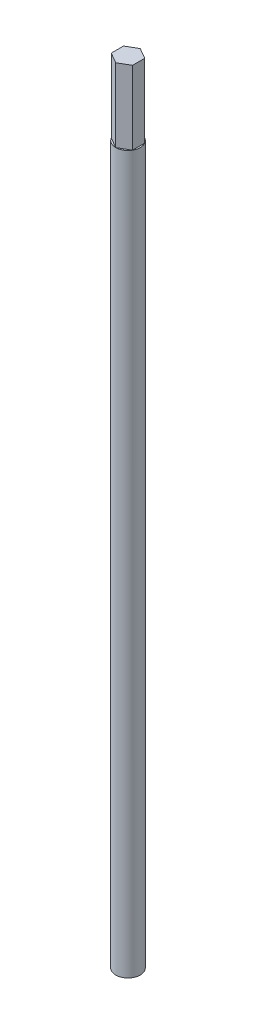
ISO-10303-21;
HEADER;
FILE_DESCRIPTION(('STEP AP214'),'2;1');
FILE_NAME('part.step','',(''),(''),'','','');
FILE_SCHEMA(('AUTOMOTIVE_DESIGN { 1 0 10303 214 1 1 1 1 }'));
ENDSEC;
DATA;
#1=APPLICATION_CONTEXT('core data for automotive mechanical design processes');
#2=APPLICATION_PROTOCOL_DEFINITION('international standard','automotive_design',2000,#1);
#3=PRODUCT_CONTEXT('',#1,'mechanical');
#4=PRODUCT('Part','Part','',(#3));
#5=PRODUCT_RELATED_PRODUCT_CATEGORY('part','',(#4));
#6=PRODUCT_DEFINITION_FORMATION('','',#4);
#7=PRODUCT_DEFINITION_CONTEXT('part definition',#1,'design');
#8=PRODUCT_DEFINITION('design','',#6,#7);
#9=PRODUCT_DEFINITION_SHAPE('','',#8);
#10=(LENGTH_UNIT() NAMED_UNIT(*) SI_UNIT(.MILLI.,.METRE.));
#11=(NAMED_UNIT(*) PLANE_ANGLE_UNIT() SI_UNIT($,.RADIAN.));
#12=(NAMED_UNIT(*) SI_UNIT($,.STERADIAN.) SOLID_ANGLE_UNIT());
#13=UNCERTAINTY_MEASURE_WITH_UNIT(LENGTH_MEASURE(1.E-05),#10,'distance_accuracy_value','');
#14=(GEOMETRIC_REPRESENTATION_CONTEXT(3) GLOBAL_UNCERTAINTY_ASSIGNED_CONTEXT((#13)) GLOBAL_UNIT_ASSIGNED_CONTEXT((#10,
#11,#12)) REPRESENTATION_CONTEXT('',''));
#15=CARTESIAN_POINT('',(0.,0.,0.));
#16=DIRECTION('',(0.,0.,1.));
#17=DIRECTION('',(1.,0.,0.));
#18=AXIS2_PLACEMENT_3D('',#15,#16,#17);
#19=CARTESIAN_POINT('',(0.,64.5,1.));
#20=DIRECTION('',(0.,-1.,0.));
#21=DIRECTION('',(0.,0.,-1.));
#22=AXIS2_PLACEMENT_3D('',#19,#20,#21);
#23=CYLINDRICAL_SURFACE('',#22,1.);
#24=DIRECTION('',(0.,-1.,0.));
#25=VECTOR('',#24,1.);
#26=CARTESIAN_POINT('',(0.5,64.5,0.13397459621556));
#27=LINE('',#26,#25);
#28=CARTESIAN_POINT('',(0.5,1.5,0.13397459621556));
#29=VERTEX_POINT('',#28);
#30=CARTESIAN_POINT('',(0.5,0.,0.13397459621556));
#31=VERTEX_POINT('',#30);
#32=EDGE_CURVE('E237',#29,#31,#27,.T.);
#33=ORIENTED_EDGE('',*,*,#32,.F.);
#34=CARTESIAN_POINT('',(0.,1.5,1.));
#35=DIRECTION('',(0.,-1.,0.));
#36=DIRECTION('',(0.,0.,-1.));
#37=AXIS2_PLACEMENT_3D('',#34,#35,#36);
#38=CIRCLE('',#37,1.);
#39=CARTESIAN_POINT('',(-0.5,1.5,0.133974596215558));
#40=VERTEX_POINT('',#39);
#41=EDGE_CURVE('E12',#40,#29,#38,.T.);
#42=ORIENTED_EDGE('',*,*,#41,.F.);
#43=DIRECTION('',(0.,-1.,0.));
#44=VECTOR('',#43,1.);
#45=CARTESIAN_POINT('',(-0.499999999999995,64.5,0.133974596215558));
#46=LINE('',#45,#44);
#47=CARTESIAN_POINT('',(-0.5,0.,0.13397459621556));
#48=VERTEX_POINT('',#47);
#49=EDGE_CURVE('E235',#48,#40,#46,.F.);
#50=ORIENTED_EDGE('',*,*,#49,.F.);
#51=CARTESIAN_POINT('',(0.,0.,1.));
#52=DIRECTION('',(0.,1.,0.));
#53=DIRECTION('',(0.,0.,1.));
#54=AXIS2_PLACEMENT_3D('',#51,#52,#53);
#55=CIRCLE('',#54,1.);
#56=EDGE_CURVE('E66',#48,#31,#55,.T.);
#57=ORIENTED_EDGE('',*,*,#56,.T.);
#58=EDGE_LOOP('',(#33,#42,#50,#57));
#59=FACE_BOUND('',#58,.T.);
#60=CARTESIAN_POINT('',(0.,58.5,1.));
#61=DIRECTION('',(0.,1.,0.));
#62=DIRECTION('',(0.,0.,1.));
#63=AXIS2_PLACEMENT_3D('',#60,#61,#62);
#64=CIRCLE('',#63,1.);
#65=CARTESIAN_POINT('',(0.866025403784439,58.5,0.499999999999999));
#66=VERTEX_POINT('',#65);
#67=CARTESIAN_POINT('',(0.,58.5,0.));
#68=VERTEX_POINT('',#67);
#69=EDGE_CURVE('E151',#66,#68,#64,.T.);
#70=ORIENTED_EDGE('',*,*,#69,.F.);
#71=CARTESIAN_POINT('',(0.,58.5,1.));
#72=DIRECTION('',(0.,1.,0.));
#73=DIRECTION('',(0.,0.,1.));
#74=AXIS2_PLACEMENT_3D('',#71,#72,#73);
#75=CIRCLE('',#74,1.);
#76=CARTESIAN_POINT('',(0.866025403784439,58.5,1.5));
#77=VERTEX_POINT('',#76);
#78=EDGE_CURVE('E146',#77,#66,#75,.T.);
#79=ORIENTED_EDGE('',*,*,#78,.F.);
#80=CARTESIAN_POINT('',(0.,58.5,1.));
#81=DIRECTION('',(0.,1.,0.));
#82=DIRECTION('',(0.,0.,1.));
#83=AXIS2_PLACEMENT_3D('',#80,#81,#82);
#84=CIRCLE('',#83,1.);
#85=CARTESIAN_POINT('',(0.,58.5,2.));
#86=VERTEX_POINT('',#85);
#87=EDGE_CURVE('E178',#86,#77,#84,.T.);
#88=ORIENTED_EDGE('',*,*,#87,.F.);
#89=CARTESIAN_POINT('',(0.,58.5,1.));
#90=DIRECTION('',(0.,1.,0.));
#91=DIRECTION('',(0.,0.,1.));
#92=AXIS2_PLACEMENT_3D('',#89,#90,#91);
#93=CIRCLE('',#92,1.);
#94=CARTESIAN_POINT('',(-0.866025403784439,58.5,1.5));
#95=VERTEX_POINT('',#94);
#96=EDGE_CURVE('E189',#95,#86,#93,.T.);
#97=ORIENTED_EDGE('',*,*,#96,.F.);
#98=CARTESIAN_POINT('',(0.,58.5,1.));
#99=DIRECTION('',(0.,1.,0.));
#100=DIRECTION('',(0.,0.,1.));
#101=AXIS2_PLACEMENT_3D('',#98,#99,#100);
#102=CIRCLE('',#101,1.);
#103=CARTESIAN_POINT('',(-0.86602540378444,58.5,0.5));
#104=VERTEX_POINT('',#103);
#105=EDGE_CURVE('E199',#104,#95,#102,.T.);
#106=ORIENTED_EDGE('',*,*,#105,.F.);
#107=CARTESIAN_POINT('',(0.,58.5,1.));
#108=DIRECTION('',(0.,1.,0.));
#109=DIRECTION('',(0.,0.,1.));
#110=AXIS2_PLACEMENT_3D('',#107,#108,#109);
#111=CIRCLE('',#110,1.);
#112=EDGE_CURVE('E163',#68,#104,#111,.T.);
#113=ORIENTED_EDGE('',*,*,#112,.F.);
#114=EDGE_LOOP('',(#70,#79,#88,#97,#106,#113));
#115=FACE_BOUND('',#114,.T.);
#116=ADVANCED_FACE('F59',(#59,#115),#23,.T.);
#117=CARTESIAN_POINT('',(0.,64.5,1.));
#118=DIRECTION('',(0.,1.,0.));
#119=DIRECTION('',(0.,0.,1.));
#120=AXIS2_PLACEMENT_3D('',#117,#118,#119);
#121=PLANE('',#120);
#122=DIRECTION('',(0.,0.,-1.));
#123=VECTOR('',#122,1.);
#124=CARTESIAN_POINT('',(0.866025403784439,64.5,0.));
#125=LINE('',#124,#123);
#126=CARTESIAN_POINT('',(0.866025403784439,64.5,1.5));
#127=VERTEX_POINT('',#126);
#128=CARTESIAN_POINT('',(0.866025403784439,64.5,0.499999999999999));
#129=VERTEX_POINT('',#128);
#130=EDGE_CURVE('E153',#127,#129,#125,.T.);
#131=ORIENTED_EDGE('',*,*,#130,.T.);
#132=DIRECTION('',(-0.866025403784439,0.,-0.5));
#133=VECTOR('',#132,1.);
#134=CARTESIAN_POINT('',(0.,64.5,0.));
#135=LINE('',#134,#133);
#136=CARTESIAN_POINT('',(0.,64.5,0.));
#137=VERTEX_POINT('',#136);
#138=EDGE_CURVE('E141',#129,#137,#135,.T.);
#139=ORIENTED_EDGE('',*,*,#138,.T.);
#140=DIRECTION('',(-0.866025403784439,0.,0.5));
#141=VECTOR('',#140,1.);
#142=CARTESIAN_POINT('',(0.,64.5,0.));
#143=LINE('',#142,#141);
#144=CARTESIAN_POINT('',(-0.86602540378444,64.5,0.5));
#145=VERTEX_POINT('',#144);
#146=EDGE_CURVE('E205',#137,#145,#143,.T.);
#147=ORIENTED_EDGE('',*,*,#146,.T.);
#148=DIRECTION('',(0.,0.,1.));
#149=VECTOR('',#148,1.);
#150=CARTESIAN_POINT('',(-0.866025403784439,64.5,0.));
#151=LINE('',#150,#149);
#152=CARTESIAN_POINT('',(-0.866025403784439,64.5,1.5));
#153=VERTEX_POINT('',#152);
#154=EDGE_CURVE('E73',#145,#153,#151,.T.);
#155=ORIENTED_EDGE('',*,*,#154,.T.);
#156=DIRECTION('',(0.866025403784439,0.,0.5));
#157=VECTOR('',#156,1.);
#158=CARTESIAN_POINT('',(-0.866025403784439,64.5,1.5));
#159=LINE('',#158,#157);
#160=CARTESIAN_POINT('',(0.,64.5,2.));
#161=VERTEX_POINT('',#160);
#162=EDGE_CURVE('E184',#153,#161,#159,.T.);
#163=ORIENTED_EDGE('',*,*,#162,.T.);
#164=DIRECTION('',(0.866025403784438,0.,-0.5));
#165=VECTOR('',#164,1.);
#166=CARTESIAN_POINT('',(0.86602540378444,64.5,1.5));
#167=LINE('',#166,#165);
#168=EDGE_CURVE('E170',#161,#127,#167,.T.);
#169=ORIENTED_EDGE('',*,*,#168,.T.);
#170=EDGE_LOOP('',(#131,#139,#147,#155,#163,#169));
#171=FACE_BOUND('',#170,.T.);
#172=ADVANCED_FACE('F269',(#171),#121,.T.);
#173=CARTESIAN_POINT('',(0.,0.,1.));
#174=DIRECTION('',(0.,1.,0.));
#175=DIRECTION('',(0.,0.,1.));
#176=AXIS2_PLACEMENT_3D('',#173,#174,#175);
#177=PLANE('',#176);
#178=DIRECTION('',(0.,0.,-1.));
#179=VECTOR('',#178,1.);
#180=CARTESIAN_POINT('',(0.5,0.,1.));
#181=LINE('',#180,#179);
#182=CARTESIAN_POINT('',(0.5,0.,1.));
#183=VERTEX_POINT('',#182);
#184=EDGE_CURVE('E224',#183,#31,#181,.T.);
#185=ORIENTED_EDGE('',*,*,#184,.T.);
#186=ORIENTED_EDGE('',*,*,#56,.F.);
#187=DIRECTION('',(0.,0.,-1.));
#188=VECTOR('',#187,1.);
#189=CARTESIAN_POINT('',(-0.5,0.,1.));
#190=LINE('',#189,#188);
#191=CARTESIAN_POINT('',(-0.5,0.,1.));
#192=VERTEX_POINT('',#191);
#193=EDGE_CURVE('E227',#192,#48,#190,.T.);
#194=ORIENTED_EDGE('',*,*,#193,.F.);
#195=DIRECTION('',(1.,0.,0.));
#196=VECTOR('',#195,1.);
#197=CARTESIAN_POINT('',(-0.5,0.,1.));
#198=LINE('',#197,#196);
#199=EDGE_CURVE('E221',#192,#183,#198,.T.);
#200=ORIENTED_EDGE('',*,*,#199,.T.);
#201=EDGE_LOOP('',(#185,#186,#194,#200));
#202=FACE_BOUND('',#201,.T.);
#203=ADVANCED_FACE('F246',(#202),#177,.F.);
#204=CARTESIAN_POINT('',(-0.5,1.5,1.));
#205=DIRECTION('',(0.,-1.,0.));
#206=DIRECTION('',(0.,0.,-1.));
#207=AXIS2_PLACEMENT_3D('',#204,#205,#206);
#208=PLANE('',#207);
#209=ORIENTED_EDGE('',*,*,#41,.T.);
#210=DIRECTION('',(0.,0.,-1.));
#211=VECTOR('',#210,1.);
#212=CARTESIAN_POINT('',(0.5,1.5,1.));
#213=LINE('',#212,#211);
#214=CARTESIAN_POINT('',(0.5,1.5,1.));
#215=VERTEX_POINT('',#214);
#216=EDGE_CURVE('E232',#215,#29,#213,.T.);
#217=ORIENTED_EDGE('',*,*,#216,.F.);
#218=DIRECTION('',(-1.,0.,0.));
#219=VECTOR('',#218,1.);
#220=CARTESIAN_POINT('',(-0.5,1.5,1.));
#221=LINE('',#220,#219);
#222=CARTESIAN_POINT('',(-0.5,1.5,1.));
#223=VERTEX_POINT('',#222);
#224=EDGE_CURVE('E217',#215,#223,#221,.T.);
#225=ORIENTED_EDGE('',*,*,#224,.T.);
#226=DIRECTION('',(0.,0.,-1.));
#227=VECTOR('',#226,1.);
#228=CARTESIAN_POINT('',(-0.5,1.5,1.));
#229=LINE('',#228,#227);
#230=EDGE_CURVE('E229',#223,#40,#229,.T.);
#231=ORIENTED_EDGE('',*,*,#230,.T.);
#232=EDGE_LOOP('',(#209,#217,#225,#231));
#233=FACE_BOUND('',#232,.T.);
#234=ADVANCED_FACE('F251',(#233),#208,.T.);
#235=CARTESIAN_POINT('',(0.5,0.,1.));
#236=DIRECTION('',(-1.,0.,0.));
#237=DIRECTION('',(0.,0.,1.));
#238=AXIS2_PLACEMENT_3D('',#235,#236,#237);
#239=PLANE('',#238);
#240=ORIENTED_EDGE('',*,*,#32,.T.);
#241=ORIENTED_EDGE('',*,*,#184,.F.);
#242=DIRECTION('',(0.,1.,0.));
#243=VECTOR('',#242,1.);
#244=CARTESIAN_POINT('',(0.5,0.,1.));
#245=LINE('',#244,#243);
#246=EDGE_CURVE('E81',#183,#215,#245,.T.);
#247=ORIENTED_EDGE('',*,*,#246,.T.);
#248=ORIENTED_EDGE('',*,*,#216,.T.);
#249=EDGE_LOOP('',(#240,#241,#247,#248));
#250=FACE_BOUND('',#249,.T.);
#251=ADVANCED_FACE('F248',(#250),#239,.T.);
#252=CARTESIAN_POINT('',(-0.5,0.,1.));
#253=DIRECTION('',(1.,0.,0.));
#254=DIRECTION('',(0.,1.,0.));
#255=AXIS2_PLACEMENT_3D('',#252,#253,#254);
#256=PLANE('',#255);
#257=ORIENTED_EDGE('',*,*,#49,.T.);
#258=ORIENTED_EDGE('',*,*,#230,.F.);
#259=DIRECTION('',(0.,-1.,0.));
#260=VECTOR('',#259,1.);
#261=CARTESIAN_POINT('',(-0.5,0.,1.));
#262=LINE('',#261,#260);
#263=EDGE_CURVE('E219',#223,#192,#262,.T.);
#264=ORIENTED_EDGE('',*,*,#263,.T.);
#265=ORIENTED_EDGE('',*,*,#193,.T.);
#266=EDGE_LOOP('',(#257,#258,#264,#265));
#267=FACE_BOUND('',#266,.T.);
#268=ADVANCED_FACE('F255',(#267),#256,.T.);
#269=CARTESIAN_POINT('',(0.,0.,1.));
#270=DIRECTION('',(0.,0.,-1.));
#271=DIRECTION('',(-1.,0.,0.));
#272=AXIS2_PLACEMENT_3D('',#269,#270,#271);
#273=PLANE('',#272);
#274=ORIENTED_EDGE('',*,*,#246,.F.);
#275=ORIENTED_EDGE('',*,*,#199,.F.);
#276=ORIENTED_EDGE('',*,*,#263,.F.);
#277=ORIENTED_EDGE('',*,*,#224,.F.);
#278=EDGE_LOOP('',(#274,#275,#276,#277));
#279=FACE_BOUND('',#278,.T.);
#280=ADVANCED_FACE('F256',(#279),#273,.T.);
#281=CARTESIAN_POINT('',(0.,58.5,0.));
#282=DIRECTION('',(-0.5,0.,-0.866025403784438));
#283=DIRECTION('',(-0.866025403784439,0.,0.5));
#284=AXIS2_PLACEMENT_3D('',#281,#282,#283);
#285=PLANE('',#284);
#286=ORIENTED_EDGE('',*,*,#146,.F.);
#287=DIRECTION('',(0.,1.,0.));
#288=VECTOR('',#287,1.);
#289=CARTESIAN_POINT('',(0.,58.5,0.));
#290=LINE('',#289,#288);
#291=EDGE_CURVE('E210',#68,#137,#290,.T.);
#292=ORIENTED_EDGE('',*,*,#291,.F.);
#293=DIRECTION('',(-0.866025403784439,0.,0.5));
#294=VECTOR('',#293,1.);
#295=CARTESIAN_POINT('',(0.,58.5,0.));
#296=LINE('',#295,#294);
#297=EDGE_CURVE('E206',#68,#104,#296,.T.);
#298=ORIENTED_EDGE('',*,*,#297,.T.);
#299=DIRECTION('',(0.,1.,0.));
#300=VECTOR('',#299,1.);
#301=CARTESIAN_POINT('',(-0.86602540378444,58.5,0.5));
#302=LINE('',#301,#300);
#303=EDGE_CURVE('E213',#104,#145,#302,.T.);
#304=ORIENTED_EDGE('',*,*,#303,.T.);
#305=EDGE_LOOP('',(#286,#292,#298,#304));
#306=FACE_BOUND('',#305,.T.);
#307=ADVANCED_FACE('F258',(#306),#285,.T.);
#308=CARTESIAN_POINT('',(0.,58.5,0.));
#309=DIRECTION('',(0.,1.,0.));
#310=DIRECTION('',(0.,0.,1.));
#311=AXIS2_PLACEMENT_3D('',#308,#309,#310);
#312=PLANE('',#311);
#313=ORIENTED_EDGE('',*,*,#297,.F.);
#314=ORIENTED_EDGE('',*,*,#112,.T.);
#315=EDGE_LOOP('',(#313,#314));
#316=FACE_BOUND('',#315,.T.);
#317=ADVANCED_FACE('F264',(#316),#312,.T.);
#318=CARTESIAN_POINT('',(-0.866025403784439,58.5,0.));
#319=DIRECTION('',(-1.,0.,0.));
#320=DIRECTION('',(0.,0.,1.));
#321=AXIS2_PLACEMENT_3D('',#318,#319,#320);
#322=PLANE('',#321);
#323=ORIENTED_EDGE('',*,*,#154,.F.);
#324=ORIENTED_EDGE('',*,*,#303,.F.);
#325=DIRECTION('',(0.,0.,1.));
#326=VECTOR('',#325,1.);
#327=CARTESIAN_POINT('',(-0.866025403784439,58.5,0.));
#328=LINE('',#327,#326);
#329=EDGE_CURVE('E198',#104,#95,#328,.T.);
#330=ORIENTED_EDGE('',*,*,#329,.T.);
#331=DIRECTION('',(0.,1.,0.));
#332=VECTOR('',#331,1.);
#333=CARTESIAN_POINT('',(-0.866025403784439,58.5,1.5));
#334=LINE('',#333,#332);
#335=EDGE_CURVE('E196',#95,#153,#334,.T.);
#336=ORIENTED_EDGE('',*,*,#335,.T.);
#337=EDGE_LOOP('',(#323,#324,#330,#336));
#338=FACE_BOUND('',#337,.T.);
#339=ADVANCED_FACE('F321',(#338),#322,.T.);
#340=CARTESIAN_POINT('',(0.,58.5,0.));
#341=DIRECTION('',(0.,1.,0.));
#342=DIRECTION('',(0.,0.,1.));
#343=AXIS2_PLACEMENT_3D('',#340,#341,#342);
#344=PLANE('',#343);
#345=ORIENTED_EDGE('',*,*,#329,.F.);
#346=ORIENTED_EDGE('',*,*,#105,.T.);
#347=EDGE_LOOP('',(#345,#346));
#348=FACE_BOUND('',#347,.T.);
#349=ADVANCED_FACE('F331',(#348),#344,.T.);
#350=CARTESIAN_POINT('',(-0.866025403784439,58.5,1.5));
#351=DIRECTION('',(-0.5,0.,0.866025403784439));
#352=DIRECTION('',(0.866025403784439,0.,0.5));
#353=AXIS2_PLACEMENT_3D('',#350,#351,#352);
#354=PLANE('',#353);
#355=ORIENTED_EDGE('',*,*,#162,.F.);
#356=ORIENTED_EDGE('',*,*,#335,.F.);
#357=DIRECTION('',(0.866025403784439,0.,0.5));
#358=VECTOR('',#357,1.);
#359=CARTESIAN_POINT('',(-0.866025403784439,58.5,1.5));
#360=LINE('',#359,#358);
#361=EDGE_CURVE('E188',#95,#86,#360,.T.);
#362=ORIENTED_EDGE('',*,*,#361,.T.);
#363=DIRECTION('',(0.,1.,0.));
#364=VECTOR('',#363,1.);
#365=CARTESIAN_POINT('',(0.,58.5,2.));
#366=LINE('',#365,#364);
#367=EDGE_CURVE('E185',#86,#161,#366,.T.);
#368=ORIENTED_EDGE('',*,*,#367,.T.);
#369=EDGE_LOOP('',(#355,#356,#362,#368));
#370=FACE_BOUND('',#369,.T.);
#371=ADVANCED_FACE('F340',(#370),#354,.T.);
#372=CARTESIAN_POINT('',(0.,58.5,0.));
#373=DIRECTION('',(0.,1.,0.));
#374=DIRECTION('',(0.,0.,1.));
#375=AXIS2_PLACEMENT_3D('',#372,#373,#374);
#376=PLANE('',#375);
#377=ORIENTED_EDGE('',*,*,#361,.F.);
#378=ORIENTED_EDGE('',*,*,#96,.T.);
#379=EDGE_LOOP('',(#377,#378));
#380=FACE_BOUND('',#379,.T.);
#381=ADVANCED_FACE('F350',(#380),#376,.T.);
#382=CARTESIAN_POINT('',(0.86602540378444,58.5,1.5));
#383=DIRECTION('',(0.5,0.,0.866025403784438));
#384=DIRECTION('',(0.866025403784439,0.,-0.5));
#385=AXIS2_PLACEMENT_3D('',#382,#383,#384);
#386=PLANE('',#385);
#387=ORIENTED_EDGE('',*,*,#168,.F.);
#388=ORIENTED_EDGE('',*,*,#367,.F.);
#389=DIRECTION('',(0.866025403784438,0.,-0.5));
#390=VECTOR('',#389,1.);
#391=CARTESIAN_POINT('',(0.86602540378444,58.5,1.5));
#392=LINE('',#391,#390);
#393=EDGE_CURVE('E177',#86,#77,#392,.T.);
#394=ORIENTED_EDGE('',*,*,#393,.T.);
#395=DIRECTION('',(0.,1.,0.));
#396=VECTOR('',#395,1.);
#397=CARTESIAN_POINT('',(0.866025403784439,58.5,1.5));
#398=LINE('',#397,#396);
#399=EDGE_CURVE('E168',#77,#127,#398,.T.);
#400=ORIENTED_EDGE('',*,*,#399,.T.);
#401=EDGE_LOOP('',(#387,#388,#394,#400));
#402=FACE_BOUND('',#401,.T.);
#403=ADVANCED_FACE('F360',(#402),#386,.T.);
#404=CARTESIAN_POINT('',(0.,58.5,0.));
#405=DIRECTION('',(0.,1.,0.));
#406=DIRECTION('',(0.,0.,1.));
#407=AXIS2_PLACEMENT_3D('',#404,#405,#406);
#408=PLANE('',#407);
#409=ORIENTED_EDGE('',*,*,#393,.F.);
#410=ORIENTED_EDGE('',*,*,#87,.T.);
#411=EDGE_LOOP('',(#409,#410));
#412=FACE_BOUND('',#411,.T.);
#413=ADVANCED_FACE('F370',(#412),#408,.T.);
#414=CARTESIAN_POINT('',(0.866025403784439,58.5,0.));
#415=DIRECTION('',(1.,0.,0.));
#416=DIRECTION('',(0.,0.,-1.));
#417=AXIS2_PLACEMENT_3D('',#414,#415,#416);
#418=PLANE('',#417);
#419=ORIENTED_EDGE('',*,*,#130,.F.);
#420=ORIENTED_EDGE('',*,*,#399,.F.);
#421=DIRECTION('',(0.,0.,-1.));
#422=VECTOR('',#421,1.);
#423=CARTESIAN_POINT('',(0.866025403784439,58.5,0.));
#424=LINE('',#423,#422);
#425=EDGE_CURVE('E145',#77,#66,#424,.T.);
#426=ORIENTED_EDGE('',*,*,#425,.T.);
#427=DIRECTION('',(0.,1.,0.));
#428=VECTOR('',#427,1.);
#429=CARTESIAN_POINT('',(0.866025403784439,58.5,0.499999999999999));
#430=LINE('',#429,#428);
#431=EDGE_CURVE('E135',#66,#129,#430,.T.);
#432=ORIENTED_EDGE('',*,*,#431,.T.);
#433=EDGE_LOOP('',(#419,#420,#426,#432));
#434=FACE_BOUND('',#433,.T.);
#435=ADVANCED_FACE('F166',(#434),#418,.T.);
#436=CARTESIAN_POINT('',(0.,58.5,0.));
#437=DIRECTION('',(0.,1.,0.));
#438=DIRECTION('',(0.,0.,1.));
#439=AXIS2_PLACEMENT_3D('',#436,#437,#438);
#440=PLANE('',#439);
#441=ORIENTED_EDGE('',*,*,#425,.F.);
#442=ORIENTED_EDGE('',*,*,#78,.T.);
#443=EDGE_LOOP('',(#441,#442));
#444=FACE_BOUND('',#443,.T.);
#445=ADVANCED_FACE('F172',(#444),#440,.T.);
#446=CARTESIAN_POINT('',(0.,58.5,0.));
#447=DIRECTION('',(0.5,0.,-0.866025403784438));
#448=DIRECTION('',(-0.866025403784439,0.,-0.5));
#449=AXIS2_PLACEMENT_3D('',#446,#447,#448);
#450=PLANE('',#449);
#451=ORIENTED_EDGE('',*,*,#138,.F.);
#452=ORIENTED_EDGE('',*,*,#431,.F.);
#453=DIRECTION('',(-0.866025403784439,0.,-0.5));
#454=VECTOR('',#453,1.);
#455=CARTESIAN_POINT('',(0.,58.5,0.));
#456=LINE('',#455,#454);
#457=EDGE_CURVE('E138',#66,#68,#456,.T.);
#458=ORIENTED_EDGE('',*,*,#457,.T.);
#459=ORIENTED_EDGE('',*,*,#291,.T.);
#460=EDGE_LOOP('',(#451,#452,#458,#459));
#461=FACE_BOUND('',#460,.T.);
#462=ADVANCED_FACE('F137',(#461),#450,.T.);
#463=CARTESIAN_POINT('',(0.,58.5,0.));
#464=DIRECTION('',(0.,1.,0.));
#465=DIRECTION('',(0.,0.,1.));
#466=AXIS2_PLACEMENT_3D('',#463,#464,#465);
#467=PLANE('',#466);
#468=ORIENTED_EDGE('',*,*,#457,.F.);
#469=ORIENTED_EDGE('',*,*,#69,.T.);
#470=EDGE_LOOP('',(#468,#469));
#471=FACE_BOUND('',#470,.T.);
#472=ADVANCED_FACE('F150',(#471),#467,.T.);
#473=CLOSED_SHELL('',(#116,#172,#203,#234,#251,#268,#280,#307,#317,#339,#349,#371,#381,#403,
#413,#435,#445,#462,#472));
#474=MANIFOLD_SOLID_BREP('B2',#473);
#475=ADVANCED_BREP_SHAPE_REPRESENTATION('',(#18,#474),#14);
#476=SHAPE_DEFINITION_REPRESENTATION(#9,#475);
ENDSEC;
END-ISO-10303-21;
